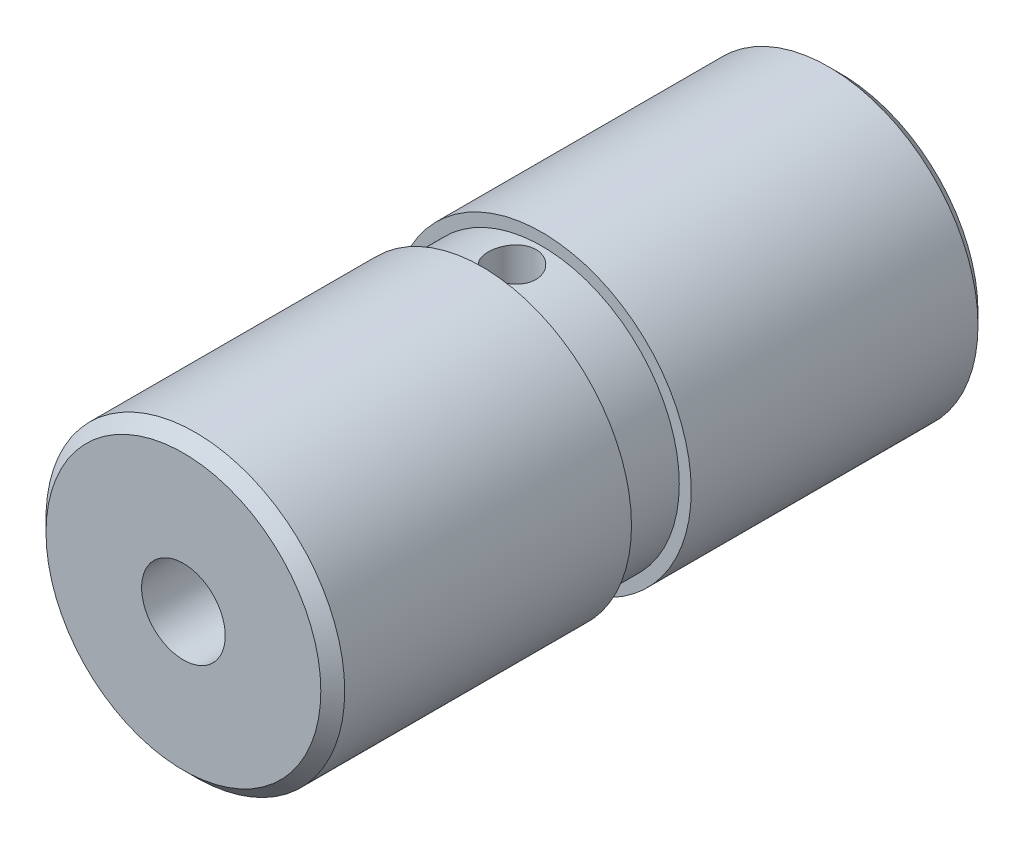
from build123d import *

# Parameters (mm, degrees)
SCHIZZO1_R                            = 12.5
ESTRUSIONE1_DEPTH                     = 55
SMUSSO1_SIZE                          = 1
F_4_0_4_FORO_DIAMETRALE1_D            = 4
M8X1_0_FORO_FILETTATO_PROFONDO1_D     = 7
M8X1_0_FORO_FILETTATO_PROFONDO1_DEPTH = 21
M8X1_0_FORO_FILETTATO_PROFONDO1_TIP   = 2.103012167
M8X1_0_FORO_FILETTATO_PROFONDO2_D     = 7
M8X1_0_FORO_FILETTATO_PROFONDO2_DEPTH = 21
M8X1_0_FORO_FILETTATO_PROFONDO2_TIP   = 2.103012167
SCHIZZO8_W                            = 2
SCHIZZO8_H                            = 12.5
SCHIZZO10_W                           = 5
SCHIZZO10_H                           = 1


with BuildPart() as part:
    # Schizzo1 → Estrusione1 (new body)
    with BuildSketch(Plane.XY):
        Circle(SCHIZZO1_R)
    extrude(amount=ESTRUSIONE1_DEPTH)

    # Smusso1
    smusso1_edges = [part.edges().sort_by_distance(p)[0] for p in [
        (-12.5, 0, 0),
        (-12.5, 0, 55),
    ]]
    chamfer(smusso1_edges, length=SMUSSO1_SIZE)

    # 4.0 _4_ Foro diametrale1 (through all)
    with Locations(Plane(origin=(0, 0, 0), x_dir=(-1, 0, 0), z_dir=(0, 0, -1))):
        with Locations((0, 0)):
            Hole(F_4_0_4_FORO_DIAMETRALE1_D / 2)

    # M8x1.0 Foro filettato profondo1
    with Locations(Plane(origin=(0, 0, 0), x_dir=(-1, 0, 0), z_dir=(0, 0, -1))):
        with Locations((0, 0)):
            Hole(M8X1_0_FORO_FILETTATO_PROFONDO1_D / 2, depth=M8X1_0_FORO_FILETTATO_PROFONDO1_DEPTH)
            with Locations((0, 0, -(M8X1_0_FORO_FILETTATO_PROFONDO1_DEPTH + M8X1_0_FORO_FILETTATO_PROFONDO1_TIP / 2))):  # 118° drill point
                Cone(0, M8X1_0_FORO_FILETTATO_PROFONDO1_D / 2, M8X1_0_FORO_FILETTATO_PROFONDO1_TIP, mode=Mode.SUBTRACT)

    # M8x1.0 Foro filettato profondo2
    with Locations(Plane.XY.offset(55)):
        with Locations((0, 0)):
            Hole(M8X1_0_FORO_FILETTATO_PROFONDO2_D / 2, depth=M8X1_0_FORO_FILETTATO_PROFONDO2_DEPTH)
            with Locations((0, 0, -(M8X1_0_FORO_FILETTATO_PROFONDO2_DEPTH + M8X1_0_FORO_FILETTATO_PROFONDO2_TIP / 2))):  # 118° drill point
                Cone(0, M8X1_0_FORO_FILETTATO_PROFONDO2_D / 2, M8X1_0_FORO_FILETTATO_PROFONDO2_TIP, mode=Mode.SUBTRACT)

    # Schizzo8 → 4.0 _4_ Foro diametrale2 (revolve, cut)
    with BuildSketch(Plane(origin=(0, 0, 27.5), x_dir=(0, 0, -1), z_dir=(1, 0, 0))):
        with Locations((1, 6.25)):
            Rectangle(SCHIZZO8_W, SCHIZZO8_H)
    revolve(axis=Axis((0, -6.35, 27.5), (0, 1, 0)), mode=Mode.SUBTRACT)

    # Schizzo10 → Taglia-Rivoluzione1 (revolve, cut)
    with BuildSketch(Plane(origin=(0, 0, 0), x_dir=(0, 0, -1), z_dir=(1, 0, 0)), mode=Mode.PRIVATE) as taglia_rivoluzione1_sk:
        with Locations((-27.5, -12)):
            Rectangle(SCHIZZO10_W, SCHIZZO10_H)
    revolve(taglia_rivoluzione1_sk.sketch.rotate(Axis((0, 0, 55), (0, 0, -1)), 270), axis=Axis((0, 0, 55), (0, 0, -1)), mode=Mode.SUBTRACT)


solid = part.part
